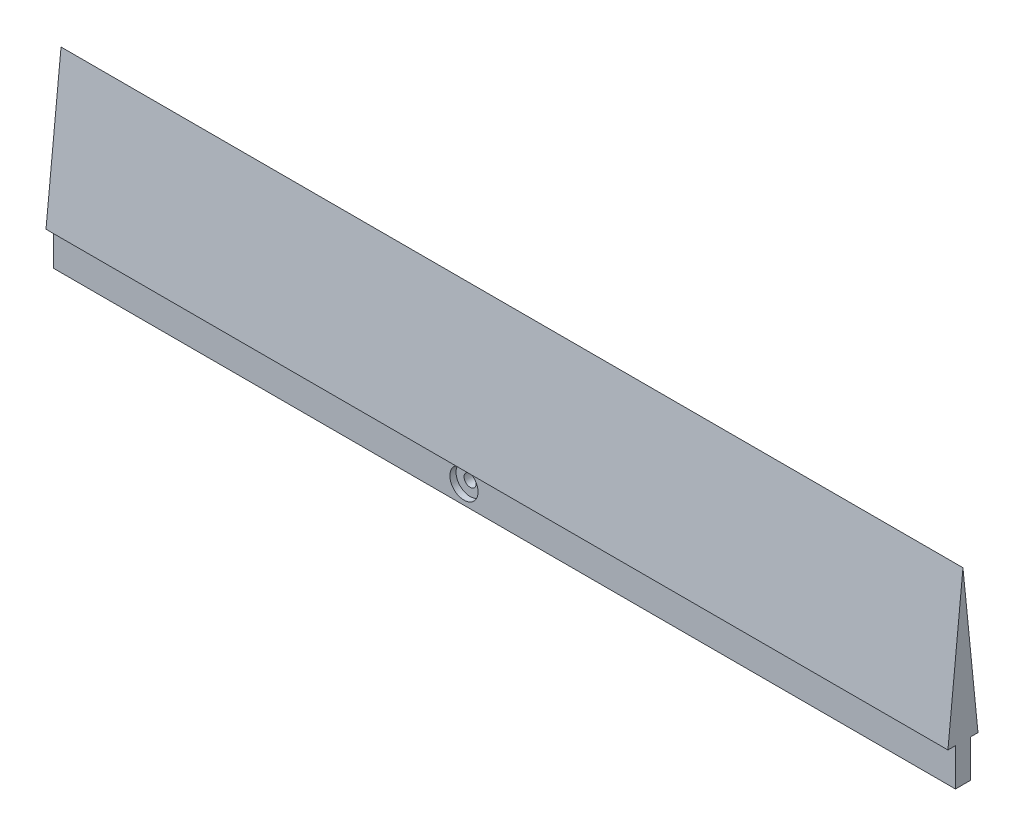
ISO-10303-21;
HEADER;
FILE_DESCRIPTION(('STEP AP214'),'2;1');
FILE_NAME('part.step','',(''),(''),'','','');
FILE_SCHEMA(('AUTOMOTIVE_DESIGN { 1 0 10303 214 1 1 1 1 }'));
ENDSEC;
DATA;
#1=APPLICATION_CONTEXT('core data for automotive mechanical design processes');
#2=APPLICATION_PROTOCOL_DEFINITION('international standard','automotive_design',2000,#1);
#3=PRODUCT_CONTEXT('',#1,'mechanical');
#4=PRODUCT('Part','Part','',(#3));
#5=PRODUCT_RELATED_PRODUCT_CATEGORY('part','',(#4));
#6=PRODUCT_DEFINITION_FORMATION('','',#4);
#7=PRODUCT_DEFINITION_CONTEXT('part definition',#1,'design');
#8=PRODUCT_DEFINITION('design','',#6,#7);
#9=PRODUCT_DEFINITION_SHAPE('','',#8);
#10=(LENGTH_UNIT() NAMED_UNIT(*) SI_UNIT(.MILLI.,.METRE.));
#11=(NAMED_UNIT(*) PLANE_ANGLE_UNIT() SI_UNIT($,.RADIAN.));
#12=(NAMED_UNIT(*) SI_UNIT($,.STERADIAN.) SOLID_ANGLE_UNIT());
#13=UNCERTAINTY_MEASURE_WITH_UNIT(LENGTH_MEASURE(1.E-05),#10,'distance_accuracy_value','');
#14=(GEOMETRIC_REPRESENTATION_CONTEXT(3) GLOBAL_UNCERTAINTY_ASSIGNED_CONTEXT((#13)) GLOBAL_UNIT_ASSIGNED_CONTEXT((#10,
#11,#12)) REPRESENTATION_CONTEXT('',''));
#15=CARTESIAN_POINT('',(0.,0.,0.));
#16=DIRECTION('',(0.,0.,1.));
#17=DIRECTION('',(1.,0.,0.));
#18=AXIS2_PLACEMENT_3D('',#15,#16,#17);
#19=CARTESIAN_POINT('',(152.4,6.35,1.26999999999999));
#20=DIRECTION('',(0.,1.,0.));
#21=DIRECTION('',(0.,0.,1.));
#22=AXIS2_PLACEMENT_3D('',#19,#20,#21);
#23=PLANE('',#22);
#24=DIRECTION('',(0.,0.,-1.));
#25=VECTOR('',#24,1.);
#26=CARTESIAN_POINT('',(0.,6.35,1.26999999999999));
#27=LINE('',#26,#25);
#28=CARTESIAN_POINT('',(0.,6.35,2.53999999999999));
#29=VERTEX_POINT('',#28);
#30=CARTESIAN_POINT('',(0.,6.35,1.26999999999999));
#31=VERTEX_POINT('',#30);
#32=EDGE_CURVE('E94',#29,#31,#27,.T.);
#33=ORIENTED_EDGE('',*,*,#32,.T.);
#34=DIRECTION('',(-1.,0.,0.));
#35=VECTOR('',#34,1.);
#36=CARTESIAN_POINT('',(152.4,6.35,1.26999999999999));
#37=LINE('',#36,#35);
#38=CARTESIAN_POINT('',(152.4,6.35,1.26999999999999));
#39=VERTEX_POINT('',#38);
#40=EDGE_CURVE('E11',#39,#31,#37,.T.);
#41=ORIENTED_EDGE('',*,*,#40,.F.);
#42=DIRECTION('',(0.,0.,-1.));
#43=VECTOR('',#42,1.);
#44=CARTESIAN_POINT('',(152.4,6.35,1.26999999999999));
#45=LINE('',#44,#43);
#46=CARTESIAN_POINT('',(152.4,6.35,2.53999999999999));
#47=VERTEX_POINT('',#46);
#48=EDGE_CURVE('E123',#47,#39,#45,.T.);
#49=ORIENTED_EDGE('',*,*,#48,.F.);
#50=DIRECTION('',(-1.,0.,0.));
#51=VECTOR('',#50,1.);
#52=CARTESIAN_POINT('',(152.4,6.35,2.53999999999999));
#53=LINE('',#52,#51);
#54=EDGE_CURVE('E107',#47,#29,#53,.T.);
#55=ORIENTED_EDGE('',*,*,#54,.T.);
#56=EDGE_LOOP('',(#33,#41,#49,#55));
#57=FACE_BOUND('',#56,.T.);
#58=ADVANCED_FACE('F31',(#57),#23,.F.);
#59=CARTESIAN_POINT('',(152.4,0.,1.26999999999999));
#60=DIRECTION('',(0.,0.,-1.));
#61=DIRECTION('',(0.,1.,0.));
#62=AXIS2_PLACEMENT_3D('',#59,#60,#61);
#63=PLANE('',#62);
#64=CARTESIAN_POINT('',(69.3538723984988,3.13600307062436,1.26999999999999));
#65=DIRECTION('',(0.,0.,1.));
#66=DIRECTION('',(0.,-1.,0.));
#67=AXIS2_PLACEMENT_3D('',#64,#65,#66);
#68=CIRCLE('',#67,2.38125);
#69=CARTESIAN_POINT('',(69.3538723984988,0.754753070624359,1.26999999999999));
#70=VERTEX_POINT('',#69);
#71=EDGE_CURVE('E110',#70,#70,#68,.T.);
#72=ORIENTED_EDGE('',*,*,#71,.F.);
#73=EDGE_LOOP('',(#72));
#74=FACE_BOUND('',#73,.T.);
#75=DIRECTION('',(0.,-1.,0.));
#76=VECTOR('',#75,1.);
#77=CARTESIAN_POINT('',(0.,0.,1.26999999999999));
#78=LINE('',#77,#76);
#79=CARTESIAN_POINT('',(0.,0.,1.26999999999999));
#80=VERTEX_POINT('',#79);
#81=EDGE_CURVE('E90',#31,#80,#78,.T.);
#82=ORIENTED_EDGE('',*,*,#81,.T.);
#83=DIRECTION('',(-1.,0.,0.));
#84=VECTOR('',#83,1.);
#85=CARTESIAN_POINT('',(152.4,0.,1.26999999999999));
#86=LINE('',#85,#84);
#87=CARTESIAN_POINT('',(152.4,0.,1.26999999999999));
#88=VERTEX_POINT('',#87);
#89=EDGE_CURVE('E39',#88,#80,#86,.T.);
#90=ORIENTED_EDGE('',*,*,#89,.F.);
#91=DIRECTION('',(0.,-1.,0.));
#92=VECTOR('',#91,1.);
#93=CARTESIAN_POINT('',(152.4,0.,1.26999999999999));
#94=LINE('',#93,#92);
#95=EDGE_CURVE('E103',#39,#88,#94,.T.);
#96=ORIENTED_EDGE('',*,*,#95,.F.);
#97=ORIENTED_EDGE('',*,*,#40,.T.);
#98=EDGE_LOOP('',(#82,#90,#96,#97));
#99=FACE_BOUND('',#98,.T.);
#100=ADVANCED_FACE('F102',(#74,#99),#63,.F.);
#101=CARTESIAN_POINT('',(152.4,0.,1.26999999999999));
#102=DIRECTION('',(0.,1.,0.));
#103=DIRECTION('',(0.,0.,1.));
#104=AXIS2_PLACEMENT_3D('',#101,#102,#103);
#105=PLANE('',#104);
#106=DIRECTION('',(0.,0.,-1.));
#107=VECTOR('',#106,1.);
#108=CARTESIAN_POINT('',(0.,0.,1.26999999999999));
#109=LINE('',#108,#107);
#110=CARTESIAN_POINT('',(0.,0.,-1.27000000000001));
#111=VERTEX_POINT('',#110);
#112=EDGE_CURVE('E96',#80,#111,#109,.T.);
#113=ORIENTED_EDGE('',*,*,#112,.T.);
#114=DIRECTION('',(-1.,0.,0.));
#115=VECTOR('',#114,1.);
#116=CARTESIAN_POINT('',(152.4,0.,-1.27000000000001));
#117=LINE('',#116,#115);
#118=CARTESIAN_POINT('',(152.4,0.,-1.27000000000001));
#119=VERTEX_POINT('',#118);
#120=EDGE_CURVE('E144',#119,#111,#117,.T.);
#121=ORIENTED_EDGE('',*,*,#120,.F.);
#122=DIRECTION('',(0.,0.,-1.));
#123=VECTOR('',#122,1.);
#124=CARTESIAN_POINT('',(152.4,0.,1.26999999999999));
#125=LINE('',#124,#123);
#126=EDGE_CURVE('E126',#88,#119,#125,.T.);
#127=ORIENTED_EDGE('',*,*,#126,.F.);
#128=ORIENTED_EDGE('',*,*,#89,.T.);
#129=EDGE_LOOP('',(#113,#121,#127,#128));
#130=FACE_BOUND('',#129,.T.);
#131=ADVANCED_FACE('F149',(#130),#105,.F.);
#132=CARTESIAN_POINT('',(152.4,0.,-1.27000000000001));
#133=DIRECTION('',(0.,0.,1.));
#134=DIRECTION('',(0.,-1.,0.));
#135=AXIS2_PLACEMENT_3D('',#132,#133,#134);
#136=PLANE('',#135);
#137=CARTESIAN_POINT('',(69.3538723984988,3.13600307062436,-1.27000000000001));
#138=DIRECTION('',(0.,0.,1.));
#139=DIRECTION('',(0.,-1.,0.));
#140=AXIS2_PLACEMENT_3D('',#137,#138,#139);
#141=CIRCLE('',#140,1.02869999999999);
#142=CARTESIAN_POINT('',(69.3538723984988,2.10730307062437,-1.27000000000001));
#143=VERTEX_POINT('',#142);
#144=EDGE_CURVE('E34',#143,#143,#141,.T.);
#145=ORIENTED_EDGE('',*,*,#144,.T.);
#146=EDGE_LOOP('',(#145));
#147=FACE_BOUND('',#146,.T.);
#148=DIRECTION('',(0.,1.,0.));
#149=VECTOR('',#148,1.);
#150=CARTESIAN_POINT('',(0.,0.,-1.27000000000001));
#151=LINE('',#150,#149);
#152=CARTESIAN_POINT('',(0.,6.35,-1.27000000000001));
#153=VERTEX_POINT('',#152);
#154=EDGE_CURVE('E115',#111,#153,#151,.T.);
#155=ORIENTED_EDGE('',*,*,#154,.T.);
#156=DIRECTION('',(-1.,0.,0.));
#157=VECTOR('',#156,1.);
#158=CARTESIAN_POINT('',(152.4,6.35,-1.27000000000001));
#159=LINE('',#158,#157);
#160=CARTESIAN_POINT('',(152.4,6.35,-1.27000000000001));
#161=VERTEX_POINT('',#160);
#162=EDGE_CURVE('E141',#161,#153,#159,.T.);
#163=ORIENTED_EDGE('',*,*,#162,.F.);
#164=DIRECTION('',(0.,1.,0.));
#165=VECTOR('',#164,1.);
#166=CARTESIAN_POINT('',(152.4,0.,-1.27000000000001));
#167=LINE('',#166,#165);
#168=EDGE_CURVE('E128',#119,#161,#167,.T.);
#169=ORIENTED_EDGE('',*,*,#168,.F.);
#170=ORIENTED_EDGE('',*,*,#120,.T.);
#171=EDGE_LOOP('',(#155,#163,#169,#170));
#172=FACE_BOUND('',#171,.T.);
#173=ADVANCED_FACE('F157',(#147,#172),#136,.F.);
#174=CARTESIAN_POINT('',(152.4,6.35,-1.27000000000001));
#175=DIRECTION('',(0.,1.,0.));
#176=DIRECTION('',(0.,0.,1.));
#177=AXIS2_PLACEMENT_3D('',#174,#175,#176);
#178=PLANE('',#177);
#179=DIRECTION('',(0.,0.,-1.));
#180=VECTOR('',#179,1.);
#181=CARTESIAN_POINT('',(0.,6.35,-1.27000000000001));
#182=LINE('',#181,#180);
#183=CARTESIAN_POINT('',(0.,6.35,-2.54000000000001));
#184=VERTEX_POINT('',#183);
#185=EDGE_CURVE('E117',#153,#184,#182,.T.);
#186=ORIENTED_EDGE('',*,*,#185,.T.);
#187=DIRECTION('',(-1.,0.,0.));
#188=VECTOR('',#187,1.);
#189=CARTESIAN_POINT('',(152.4,6.35,-2.54000000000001));
#190=LINE('',#189,#188);
#191=CARTESIAN_POINT('',(152.4,6.35,-2.54000000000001));
#192=VERTEX_POINT('',#191);
#193=EDGE_CURVE('E138',#192,#184,#190,.T.);
#194=ORIENTED_EDGE('',*,*,#193,.F.);
#195=DIRECTION('',(0.,0.,-1.));
#196=VECTOR('',#195,1.);
#197=CARTESIAN_POINT('',(152.4,6.35,-1.27000000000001));
#198=LINE('',#197,#196);
#199=EDGE_CURVE('E130',#161,#192,#198,.T.);
#200=ORIENTED_EDGE('',*,*,#199,.F.);
#201=ORIENTED_EDGE('',*,*,#162,.T.);
#202=EDGE_LOOP('',(#186,#194,#200,#201));
#203=FACE_BOUND('',#202,.T.);
#204=ADVANCED_FACE('F160',(#203),#178,.F.);
#205=CARTESIAN_POINT('',(152.4,6.35,-2.54000000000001));
#206=DIRECTION('',(0.,-0.0995037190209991,0.995037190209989));
#207=DIRECTION('',(0.,-0.995037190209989,-0.0995037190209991));
#208=AXIS2_PLACEMENT_3D('',#205,#206,#207);
#209=PLANE('',#208);
#210=DIRECTION('',(0.,0.995037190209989,0.0995037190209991));
#211=VECTOR('',#210,1.);
#212=CARTESIAN_POINT('',(0.,6.35,-2.54000000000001));
#213=LINE('',#212,#211);
#214=CARTESIAN_POINT('',(0.,31.75,0.));
#215=VERTEX_POINT('',#214);
#216=EDGE_CURVE('E119',#184,#215,#213,.T.);
#217=ORIENTED_EDGE('',*,*,#216,.T.);
#218=DIRECTION('',(-1.,0.,0.));
#219=VECTOR('',#218,1.);
#220=CARTESIAN_POINT('',(152.4,31.75,0.));
#221=LINE('',#220,#219);
#222=CARTESIAN_POINT('',(152.4,31.75,0.));
#223=VERTEX_POINT('',#222);
#224=EDGE_CURVE('E135',#223,#215,#221,.T.);
#225=ORIENTED_EDGE('',*,*,#224,.F.);
#226=DIRECTION('',(0.,0.995037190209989,0.0995037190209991));
#227=VECTOR('',#226,1.);
#228=CARTESIAN_POINT('',(152.4,6.35,-2.54000000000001));
#229=LINE('',#228,#227);
#230=EDGE_CURVE('E51',#192,#223,#229,.T.);
#231=ORIENTED_EDGE('',*,*,#230,.F.);
#232=ORIENTED_EDGE('',*,*,#193,.T.);
#233=EDGE_LOOP('',(#217,#225,#231,#232));
#234=FACE_BOUND('',#233,.T.);
#235=ADVANCED_FACE('F163',(#234),#209,.F.);
#236=CARTESIAN_POINT('',(152.4,6.35,2.53999999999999));
#237=DIRECTION('',(0.,-0.0995037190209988,-0.995037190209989));
#238=DIRECTION('',(0.,0.995037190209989,-0.0995037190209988));
#239=AXIS2_PLACEMENT_3D('',#236,#237,#238);
#240=PLANE('',#239);
#241=DIRECTION('',(0.,-0.995037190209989,0.0995037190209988));
#242=VECTOR('',#241,1.);
#243=CARTESIAN_POINT('',(0.,6.35,2.53999999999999));
#244=LINE('',#243,#242);
#245=EDGE_CURVE('E121',#215,#29,#244,.T.);
#246=ORIENTED_EDGE('',*,*,#245,.T.);
#247=ORIENTED_EDGE('',*,*,#54,.F.);
#248=DIRECTION('',(0.,-0.995037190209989,0.0995037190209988));
#249=VECTOR('',#248,1.);
#250=CARTESIAN_POINT('',(152.4,6.35,2.53999999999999));
#251=LINE('',#250,#249);
#252=EDGE_CURVE('E46',#223,#47,#251,.T.);
#253=ORIENTED_EDGE('',*,*,#252,.F.);
#254=ORIENTED_EDGE('',*,*,#224,.T.);
#255=EDGE_LOOP('',(#246,#247,#253,#254));
#256=FACE_BOUND('',#255,.T.);
#257=ADVANCED_FACE('F165',(#256),#240,.F.);
#258=CARTESIAN_POINT('',(152.4,6.35,-1.27000000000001));
#259=DIRECTION('',(-1.,0.,0.));
#260=DIRECTION('',(0.,0.,1.));
#261=AXIS2_PLACEMENT_3D('',#258,#259,#260);
#262=PLANE('',#261);
#263=ORIENTED_EDGE('',*,*,#48,.T.);
#264=ORIENTED_EDGE('',*,*,#95,.T.);
#265=ORIENTED_EDGE('',*,*,#126,.T.);
#266=ORIENTED_EDGE('',*,*,#168,.T.);
#267=ORIENTED_EDGE('',*,*,#199,.T.);
#268=ORIENTED_EDGE('',*,*,#230,.T.);
#269=ORIENTED_EDGE('',*,*,#252,.T.);
#270=EDGE_LOOP('',(#263,#264,#265,#266,#267,#268,#269));
#271=FACE_BOUND('',#270,.T.);
#272=ADVANCED_FACE('F152',(#271),#262,.F.);
#273=CARTESIAN_POINT('',(0.,6.35,-1.27000000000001));
#274=DIRECTION('',(-1.,0.,0.));
#275=DIRECTION('',(0.,0.,1.));
#276=AXIS2_PLACEMENT_3D('',#273,#274,#275);
#277=PLANE('',#276);
#278=ORIENTED_EDGE('',*,*,#32,.F.);
#279=ORIENTED_EDGE('',*,*,#245,.F.);
#280=ORIENTED_EDGE('',*,*,#216,.F.);
#281=ORIENTED_EDGE('',*,*,#185,.F.);
#282=ORIENTED_EDGE('',*,*,#154,.F.);
#283=ORIENTED_EDGE('',*,*,#112,.F.);
#284=ORIENTED_EDGE('',*,*,#81,.F.);
#285=EDGE_LOOP('',(#278,#279,#280,#281,#282,#283,#284));
#286=FACE_BOUND('',#285,.T.);
#287=ADVANCED_FACE('F91',(#286),#277,.T.);
#288=CARTESIAN_POINT('',(69.3538723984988,3.13600307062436,1.26999999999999));
#289=DIRECTION('',(0.,0.,1.));
#290=DIRECTION('',(0.,-1.,0.));
#291=AXIS2_PLACEMENT_3D('',#288,#289,#290);
#292=CYLINDRICAL_SURFACE('',#291,1.02869999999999);
#293=CARTESIAN_POINT('',(69.3538723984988,3.13600307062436,0.228599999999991));
#294=DIRECTION('',(0.,0.,1.));
#295=DIRECTION('',(0.,-1.,0.));
#296=AXIS2_PLACEMENT_3D('',#293,#294,#295);
#297=CIRCLE('',#296,1.02869999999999);
#298=CARTESIAN_POINT('',(69.3538723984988,2.10730307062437,0.22859999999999));
#299=VERTEX_POINT('',#298);
#300=EDGE_CURVE('E263',#299,#299,#297,.T.);
#301=ORIENTED_EDGE('',*,*,#300,.T.);
#302=EDGE_LOOP('',(#301));
#303=FACE_BOUND('',#302,.T.);
#304=ORIENTED_EDGE('',*,*,#144,.F.);
#305=EDGE_LOOP('',(#304));
#306=FACE_BOUND('',#305,.T.);
#307=ADVANCED_FACE('F216',(#303,#306),#292,.F.);
#308=CARTESIAN_POINT('',(69.3538723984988,3.13600307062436,1.26999999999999));
#309=DIRECTION('',(0.,0.,1.));
#310=DIRECTION('',(0.,-1.,0.));
#311=AXIS2_PLACEMENT_3D('',#308,#309,#310);
#312=CYLINDRICAL_SURFACE('',#311,2.38125);
#313=CARTESIAN_POINT('',(69.3538723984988,3.13600307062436,0.228599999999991));
#314=DIRECTION('',(0.,0.,1.));
#315=DIRECTION('',(0.,-1.,0.));
#316=AXIS2_PLACEMENT_3D('',#313,#314,#315);
#317=CIRCLE('',#316,2.38125);
#318=CARTESIAN_POINT('',(69.3538723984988,0.754753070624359,0.22859999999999));
#319=VERTEX_POINT('',#318);
#320=EDGE_CURVE('E266',#319,#319,#317,.T.);
#321=ORIENTED_EDGE('',*,*,#320,.F.);
#322=EDGE_LOOP('',(#321));
#323=FACE_BOUND('',#322,.T.);
#324=ORIENTED_EDGE('',*,*,#71,.T.);
#325=EDGE_LOOP('',(#324));
#326=FACE_BOUND('',#325,.T.);
#327=ADVANCED_FACE('F236',(#323,#326),#312,.F.);
#328=CARTESIAN_POINT('',(70.3825723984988,3.13600307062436,0.228599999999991));
#329=DIRECTION('',(0.,0.,-1.));
#330=DIRECTION('',(0.,1.,0.));
#331=AXIS2_PLACEMENT_3D('',#328,#329,#330);
#332=PLANE('',#331);
#333=ORIENTED_EDGE('',*,*,#300,.F.);
#334=EDGE_LOOP('',(#333));
#335=FACE_BOUND('',#334,.T.);
#336=ORIENTED_EDGE('',*,*,#320,.T.);
#337=EDGE_LOOP('',(#336));
#338=FACE_BOUND('',#337,.T.);
#339=ADVANCED_FACE('F246',(#335,#338),#332,.F.);
#340=CLOSED_SHELL('',(#58,#100,#131,#173,#204,#235,#257,#272,#287,#307,#327,#339));
#341=MANIFOLD_SOLID_BREP('B2',#340);
#342=ADVANCED_BREP_SHAPE_REPRESENTATION('',(#18,#341),#14);
#343=SHAPE_DEFINITION_REPRESENTATION(#9,#342);
ENDSEC;
END-ISO-10303-21;
